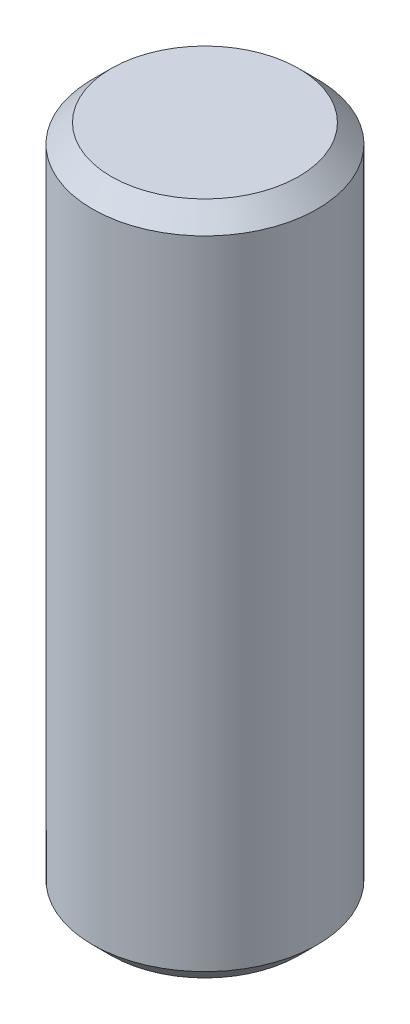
from build123d import *

# Parameters (mm, degrees)
SKETCH_1_R      = 3
EXTRUDE_1_DEPTH = 18
CHAMFER_1_SIZE  = 0.5


with BuildPart() as part:
    # Sketch 1 → Extrude 1 (new body)
    with BuildSketch(Plane(origin=(0, 0, 0), x_dir=(1, 0, 0), z_dir=(0, 1, 0))):
        with Locations(Location((0, 0, 0), (0, 0, 270))):
            Circle(SKETCH_1_R)
    extrude(amount=EXTRUDE_1_DEPTH)

    # Chamfer 1
    chamfer_1_edges = [part.edges().sort_by_distance(p)[0] for p in [
        (0, 0, -3),
        (0, 18, -3),
    ]]
    chamfer(chamfer_1_edges, length=CHAMFER_1_SIZE)


solid = part.part
